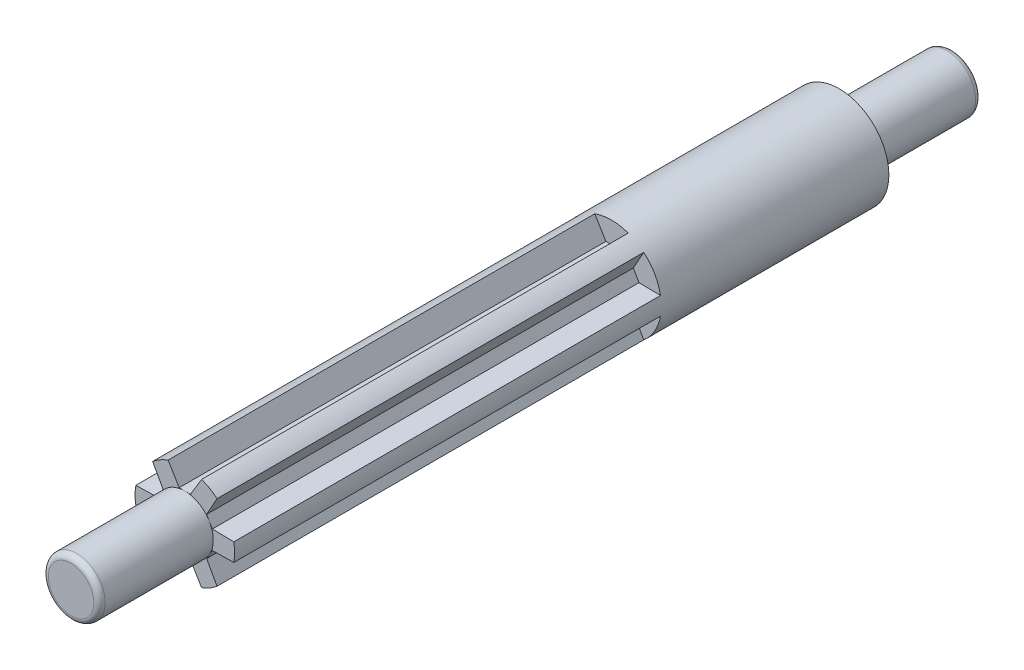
ISO-10303-21;
HEADER;
FILE_DESCRIPTION(('STEP AP214'),'2;1');
FILE_NAME('part.step','',(''),(''),'','','');
FILE_SCHEMA(('AUTOMOTIVE_DESIGN { 1 0 10303 214 1 1 1 1 }'));
ENDSEC;
DATA;
#1=APPLICATION_CONTEXT('core data for automotive mechanical design processes');
#2=APPLICATION_PROTOCOL_DEFINITION('international standard','automotive_design',2000,#1);
#3=PRODUCT_CONTEXT('',#1,'mechanical');
#4=PRODUCT('Part','Part','',(#3));
#5=PRODUCT_RELATED_PRODUCT_CATEGORY('part','',(#4));
#6=PRODUCT_DEFINITION_FORMATION('','',#4);
#7=PRODUCT_DEFINITION_CONTEXT('part definition',#1,'design');
#8=PRODUCT_DEFINITION('design','',#6,#7);
#9=PRODUCT_DEFINITION_SHAPE('','',#8);
#10=(LENGTH_UNIT() NAMED_UNIT(*) SI_UNIT(.MILLI.,.METRE.));
#11=(NAMED_UNIT(*) PLANE_ANGLE_UNIT() SI_UNIT($,.RADIAN.));
#12=(NAMED_UNIT(*) SI_UNIT($,.STERADIAN.) SOLID_ANGLE_UNIT());
#13=UNCERTAINTY_MEASURE_WITH_UNIT(LENGTH_MEASURE(1.E-05),#10,'distance_accuracy_value','');
#14=(GEOMETRIC_REPRESENTATION_CONTEXT(3) GLOBAL_UNCERTAINTY_ASSIGNED_CONTEXT((#13)) GLOBAL_UNIT_ASSIGNED_CONTEXT((#10,
#11,#12)) REPRESENTATION_CONTEXT('',''));
#15=CARTESIAN_POINT('',(0.,0.,0.));
#16=DIRECTION('',(0.,0.,1.));
#17=DIRECTION('',(1.,0.,0.));
#18=AXIS2_PLACEMENT_3D('',#15,#16,#17);
#19=CARTESIAN_POINT('',(0.,0.,23.));
#20=DIRECTION('',(0.,0.,1.));
#21=DIRECTION('',(1.,0.,0.));
#22=AXIS2_PLACEMENT_3D('',#19,#20,#21);
#23=PLANE('',#22);
#24=DIRECTION('',(0.999858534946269,-0.0168199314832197,0.));
#25=VECTOR('',#24,1.);
#26=CARTESIAN_POINT('',(0.966025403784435,0.326794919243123,23.));
#27=LINE('',#26,#25);
#28=CARTESIAN_POINT('',(0.966025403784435,0.326794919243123,23.));
#29=VERTEX_POINT('',#28);
#30=CARTESIAN_POINT('',(1.7215838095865,0.314084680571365,23.));
#31=VERTEX_POINT('',#30);
#32=EDGE_CURVE('E233',#29,#31,#27,.T.);
#33=ORIENTED_EDGE('',*,*,#32,.F.);
#34=DIRECTION('',(0.50000000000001,-0.866025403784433,0.));
#35=VECTOR('',#34,1.);
#36=CARTESIAN_POINT('',(0.766025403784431,0.673205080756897,23.));
#37=LINE('',#36,#35);
#38=CARTESIAN_POINT('',(0.866025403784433,0.50000000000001,23.));
#39=VERTEX_POINT('',#38);
#40=EDGE_CURVE('E219',#39,#29,#37,.T.);
#41=ORIENTED_EDGE('',*,*,#40,.F.);
#42=CARTESIAN_POINT('',(0.,0.,23.));
#43=DIRECTION('',(0.,0.,1.));
#44=DIRECTION('',(1.,0.,0.));
#45=AXIS2_PLACEMENT_3D('',#42,#43,#44);
#46=CIRCLE('',#45,0.999999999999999);
#47=CARTESIAN_POINT('',(0.866025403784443,-0.499999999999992,23.));
#48=VERTEX_POINT('',#47);
#49=EDGE_CURVE('E758',#48,#39,#46,.T.);
#50=ORIENTED_EDGE('',*,*,#49,.F.);
#51=DIRECTION('',(-0.499999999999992,-0.866025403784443,0.));
#52=VECTOR('',#51,1.);
#53=CARTESIAN_POINT('',(0.966025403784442,-0.326794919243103,23.));
#54=LINE('',#53,#52);
#55=CARTESIAN_POINT('',(0.966025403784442,-0.326794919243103,23.));
#56=VERTEX_POINT('',#55);
#57=EDGE_CURVE('E258',#56,#48,#54,.T.);
#58=ORIENTED_EDGE('',*,*,#57,.F.);
#59=DIRECTION('',(-0.999858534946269,-0.0168199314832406,0.));
#60=VECTOR('',#59,1.);
#61=CARTESIAN_POINT('',(2.13205080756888,-0.307179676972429,23.));
#62=LINE('',#61,#60);
#63=CARTESIAN_POINT('',(1.72158380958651,-0.314084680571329,23.));
#64=VERTEX_POINT('',#63);
#65=EDGE_CURVE('E246',#64,#56,#62,.T.);
#66=ORIENTED_EDGE('',*,*,#65,.F.);
#67=CARTESIAN_POINT('',(0.,0.,23.));
#68=DIRECTION('',(0.,0.,1.));
#69=DIRECTION('',(1.,0.,0.));
#70=AXIS2_PLACEMENT_3D('',#67,#68,#69);
#71=CIRCLE('',#70,1.75);
#72=EDGE_CURVE('E734',#64,#31,#71,.T.);
#73=ORIENTED_EDGE('',*,*,#72,.T.);
#74=EDGE_LOOP('',(#33,#41,#50,#58,#66,#73));
#75=FACE_BOUND('',#74,.T.);
#76=ADVANCED_FACE('F27',(#75),#23,.T.);
#77=DIRECTION('',(0.485362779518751,-0.874312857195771,0.));
#78=VECTOR('',#77,1.);
#79=CARTESIAN_POINT('',(0.766025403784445,-0.673205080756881,23.));
#80=LINE('',#79,#78);
#81=CARTESIAN_POINT('',(0.766025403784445,-0.673205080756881,23.));
#82=VERTEX_POINT('',#81);
#83=CARTESIAN_POINT('',(1.13279721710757,-1.33389297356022,23.));
#84=VERTEX_POINT('',#83);
#85=EDGE_CURVE('E255',#82,#84,#80,.T.);
#86=ORIENTED_EDGE('',*,*,#85,.F.);
#87=EDGE_CURVE('E260',#48,#82,#54,.T.);
#88=ORIENTED_EDGE('',*,*,#87,.F.);
#89=CARTESIAN_POINT('',(0.,-1.,23.));
#90=VERTEX_POINT('',#89);
#91=EDGE_CURVE('E757',#90,#48,#46,.T.);
#92=ORIENTED_EDGE('',*,*,#91,.F.);
#93=DIRECTION('',(-1.,0.,0.));
#94=VECTOR('',#93,1.);
#95=CARTESIAN_POINT('',(0.200000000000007,-0.999999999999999,23.));
#96=LINE('',#95,#94);
#97=CARTESIAN_POINT('',(0.200000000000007,-0.999999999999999,23.));
#98=VERTEX_POINT('',#97);
#99=EDGE_CURVE('E278',#98,#90,#96,.T.);
#100=ORIENTED_EDGE('',*,*,#99,.F.);
#101=DIRECTION('',(-0.514495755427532,0.857492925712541,0.));
#102=VECTOR('',#101,1.);
#103=CARTESIAN_POINT('',(0.800000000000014,-1.99999999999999,23.));
#104=LINE('',#103,#102);
#105=CARTESIAN_POINT('',(0.58878659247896,-1.64797765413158,23.));
#106=VERTEX_POINT('',#105);
#107=EDGE_CURVE('E265',#106,#98,#104,.T.);
#108=ORIENTED_EDGE('',*,*,#107,.F.);
#109=EDGE_CURVE('E737',#106,#84,#71,.T.);
#110=ORIENTED_EDGE('',*,*,#109,.T.);
#111=EDGE_LOOP('',(#86,#88,#92,#100,#108,#110));
#112=FACE_BOUND('',#111,.T.);
#113=ADVANCED_FACE('F426',(#112),#23,.T.);
#114=DIRECTION('',(-0.51449575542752,-0.857492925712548,0.));
#115=VECTOR('',#114,1.);
#116=CARTESIAN_POINT('',(-0.199999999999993,-1.,23.));
#117=LINE('',#116,#115);
#118=CARTESIAN_POINT('',(-0.199999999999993,-1.,23.));
#119=VERTEX_POINT('',#118);
#120=CARTESIAN_POINT('',(-0.588786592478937,-1.64797765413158,23.));
#121=VERTEX_POINT('',#120);
#122=EDGE_CURVE('E275',#119,#121,#117,.T.);
#123=ORIENTED_EDGE('',*,*,#122,.F.);
#124=EDGE_CURVE('E280',#90,#119,#96,.T.);
#125=ORIENTED_EDGE('',*,*,#124,.F.);
#126=CARTESIAN_POINT('',(-0.866025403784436,-0.500000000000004,23.));
#127=VERTEX_POINT('',#126);
#128=EDGE_CURVE('E484',#127,#90,#46,.T.);
#129=ORIENTED_EDGE('',*,*,#128,.F.);
#130=DIRECTION('',(-0.500000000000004,0.866025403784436,0.));
#131=VECTOR('',#130,1.);
#132=CARTESIAN_POINT('',(-0.766025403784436,-0.673205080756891,23.));
#133=LINE('',#132,#131);
#134=CARTESIAN_POINT('',(-0.766025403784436,-0.673205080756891,23.));
#135=VERTEX_POINT('',#134);
#136=EDGE_CURVE('E284',#135,#127,#133,.T.);
#137=ORIENTED_EDGE('',*,*,#136,.F.);
#138=DIRECTION('',(0.485362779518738,0.874312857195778,0.));
#139=VECTOR('',#138,1.);
#140=CARTESIAN_POINT('',(-1.33205080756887,-1.69282032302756,23.));
#141=LINE('',#140,#139);
#142=CARTESIAN_POINT('',(-1.13279721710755,-1.33389297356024,23.));
#143=VERTEX_POINT('',#142);
#144=EDGE_CURVE('E277',#143,#135,#141,.T.);
#145=ORIENTED_EDGE('',*,*,#144,.F.);
#146=EDGE_CURVE('E739',#143,#121,#71,.T.);
#147=ORIENTED_EDGE('',*,*,#146,.T.);
#148=EDGE_LOOP('',(#123,#125,#129,#137,#145,#147));
#149=FACE_BOUND('',#148,.T.);
#150=ADVANCED_FACE('F431',(#149),#23,.T.);
#151=DIRECTION('',(-0.999858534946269,0.0168199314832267,0.));
#152=VECTOR('',#151,1.);
#153=CARTESIAN_POINT('',(-0.966025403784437,-0.326794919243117,23.));
#154=LINE('',#153,#152);
#155=CARTESIAN_POINT('',(-0.966025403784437,-0.326794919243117,23.));
#156=VERTEX_POINT('',#155);
#157=CARTESIAN_POINT('',(-1.72158380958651,-0.314084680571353,23.));
#158=VERTEX_POINT('',#157);
#159=EDGE_CURVE('E286',#156,#158,#154,.T.);
#160=ORIENTED_EDGE('',*,*,#159,.F.);
#161=EDGE_CURVE('E283',#127,#156,#133,.T.);
#162=ORIENTED_EDGE('',*,*,#161,.F.);
#163=CARTESIAN_POINT('',(-0.86602540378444,0.499999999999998,23.));
#164=VERTEX_POINT('',#163);
#165=EDGE_CURVE('E347',#164,#127,#46,.T.);
#166=ORIENTED_EDGE('',*,*,#165,.F.);
#167=DIRECTION('',(0.499999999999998,0.86602540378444,0.));
#168=VECTOR('',#167,1.);
#169=CARTESIAN_POINT('',(-0.966025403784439,0.32679491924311,23.));
#170=LINE('',#169,#168);
#171=CARTESIAN_POINT('',(-0.966025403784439,0.32679491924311,23.));
#172=VERTEX_POINT('',#171);
#173=EDGE_CURVE('E304',#172,#164,#170,.T.);
#174=ORIENTED_EDGE('',*,*,#173,.F.);
#175=DIRECTION('',(0.999858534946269,0.0168199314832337,0.));
#176=VECTOR('',#175,1.);
#177=CARTESIAN_POINT('',(-2.13205080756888,0.307179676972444,23.));
#178=LINE('',#177,#176);
#179=CARTESIAN_POINT('',(-1.72158380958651,0.314084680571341,23.));
#180=VERTEX_POINT('',#179);
#181=EDGE_CURVE('E299',#180,#172,#178,.T.);
#182=ORIENTED_EDGE('',*,*,#181,.F.);
#183=EDGE_CURVE('E355',#180,#158,#71,.T.);
#184=ORIENTED_EDGE('',*,*,#183,.T.);
#185=EDGE_LOOP('',(#160,#162,#166,#174,#182,#184));
#186=FACE_BOUND('',#185,.T.);
#187=ADVANCED_FACE('F446',(#186),#23,.T.);
#188=DIRECTION('',(-0.485362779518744,0.874312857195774,0.));
#189=VECTOR('',#188,1.);
#190=CARTESIAN_POINT('',(-0.76602540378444,0.673205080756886,23.));
#191=LINE('',#190,#189);
#192=CARTESIAN_POINT('',(-0.76602540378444,0.673205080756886,23.));
#193=VERTEX_POINT('',#192);
#194=CARTESIAN_POINT('',(-1.13279721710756,1.33389297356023,23.));
#195=VERTEX_POINT('',#194);
#196=EDGE_CURVE('E306',#193,#195,#191,.T.);
#197=ORIENTED_EDGE('',*,*,#196,.F.);
#198=EDGE_CURVE('E303',#164,#193,#170,.T.);
#199=ORIENTED_EDGE('',*,*,#198,.F.);
#200=CARTESIAN_POINT('',(0.,1.,23.));
#201=VERTEX_POINT('',#200);
#202=EDGE_CURVE('E343',#201,#164,#46,.T.);
#203=ORIENTED_EDGE('',*,*,#202,.F.);
#204=DIRECTION('',(1.,0.,0.));
#205=VECTOR('',#204,1.);
#206=CARTESIAN_POINT('',(-0.2,1.,23.));
#207=LINE('',#206,#205);
#208=CARTESIAN_POINT('',(-0.2,1.,23.));
#209=VERTEX_POINT('',#208);
#210=EDGE_CURVE('E324',#209,#201,#207,.T.);
#211=ORIENTED_EDGE('',*,*,#210,.F.);
#212=DIRECTION('',(0.514495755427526,-0.857492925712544,0.));
#213=VECTOR('',#212,1.);
#214=CARTESIAN_POINT('',(-0.8,2.,23.));
#215=LINE('',#214,#213);
#216=CARTESIAN_POINT('',(-0.588786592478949,1.64797765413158,23.));
#217=VERTEX_POINT('',#216);
#218=EDGE_CURVE('E319',#217,#209,#215,.T.);
#219=ORIENTED_EDGE('',*,*,#218,.F.);
#220=EDGE_CURVE('E351',#217,#195,#71,.T.);
#221=ORIENTED_EDGE('',*,*,#220,.T.);
#222=EDGE_LOOP('',(#197,#199,#203,#211,#219,#221));
#223=FACE_BOUND('',#222,.T.);
#224=ADVANCED_FACE('F437',(#223),#23,.T.);
#225=CARTESIAN_POINT('',(0.,0.,0.));
#226=DIRECTION('',(0.,0.,1.));
#227=DIRECTION('',(1.,0.,0.));
#228=AXIS2_PLACEMENT_3D('',#225,#226,#227);
#229=PLANE('',#228);
#230=CARTESIAN_POINT('',(0.,0.,0.));
#231=DIRECTION('',(0.,0.,1.));
#232=DIRECTION('',(1.,0.,0.));
#233=AXIS2_PLACEMENT_3D('',#230,#231,#232);
#234=CIRCLE('',#233,1.75);
#235=CARTESIAN_POINT('',(1.75,0.,0.));
#236=VERTEX_POINT('',#235);
#237=EDGE_CURVE('E346',#236,#236,#234,.T.);
#238=ORIENTED_EDGE('',*,*,#237,.F.);
#239=EDGE_LOOP('',(#238));
#240=FACE_BOUND('',#239,.T.);
#241=CARTESIAN_POINT('',(0.,0.,0.));
#242=DIRECTION('',(0.,0.,1.));
#243=DIRECTION('',(1.,0.,0.));
#244=AXIS2_PLACEMENT_3D('',#241,#242,#243);
#245=CIRCLE('',#244,0.999999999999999);
#246=CARTESIAN_POINT('',(0.999999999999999,0.,0.));
#247=VERTEX_POINT('',#246);
#248=EDGE_CURVE('E354',#247,#247,#245,.F.);
#249=ORIENTED_EDGE('',*,*,#248,.F.);
#250=EDGE_LOOP('',(#249));
#251=FACE_BOUND('',#250,.T.);
#252=ADVANCED_FACE('F436',(#240,#251),#229,.F.);
#253=CARTESIAN_POINT('',(0.766025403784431,0.673205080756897,23.));
#254=VERTEX_POINT('',#253);
#255=EDGE_CURVE('E223',#254,#39,#37,.T.);
#256=ORIENTED_EDGE('',*,*,#255,.F.);
#257=DIRECTION('',(-0.485362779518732,-0.874312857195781,0.));
#258=VECTOR('',#257,1.);
#259=CARTESIAN_POINT('',(1.33205080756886,1.69282032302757,23.));
#260=LINE('',#259,#258);
#261=CARTESIAN_POINT('',(1.13279721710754,1.33389297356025,23.));
#262=VERTEX_POINT('',#261);
#263=EDGE_CURVE('E208',#262,#254,#260,.T.);
#264=ORIENTED_EDGE('',*,*,#263,.F.);
#265=CARTESIAN_POINT('',(0.588786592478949,1.64797765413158,23.));
#266=VERTEX_POINT('',#265);
#267=EDGE_CURVE('E350',#262,#266,#71,.T.);
#268=ORIENTED_EDGE('',*,*,#267,.T.);
#269=DIRECTION('',(0.514495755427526,0.857492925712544,0.));
#270=VECTOR('',#269,1.);
#271=CARTESIAN_POINT('',(0.2,1.,23.));
#272=LINE('',#271,#270);
#273=CARTESIAN_POINT('',(0.2,1.,23.));
#274=VERTEX_POINT('',#273);
#275=EDGE_CURVE('E327',#274,#266,#272,.T.);
#276=ORIENTED_EDGE('',*,*,#275,.F.);
#277=EDGE_CURVE('E323',#201,#274,#207,.T.);
#278=ORIENTED_EDGE('',*,*,#277,.F.);
#279=EDGE_CURVE('E231',#39,#201,#46,.T.);
#280=ORIENTED_EDGE('',*,*,#279,.F.);
#281=EDGE_LOOP('',(#256,#264,#268,#276,#278,#280));
#282=FACE_BOUND('',#281,.T.);
#283=ADVANCED_FACE('F229',(#282),#23,.T.);
#284=CARTESIAN_POINT('',(0.,0.,23.));
#285=DIRECTION('',(0.,0.,-1.));
#286=DIRECTION('',(-1.,0.,0.));
#287=AXIS2_PLACEMENT_3D('',#284,#285,#286);
#288=CYLINDRICAL_SURFACE('',#287,1.75);
#289=CARTESIAN_POINT('',(0.,0.,8.));
#290=DIRECTION('',(0.,0.,1.));
#291=DIRECTION('',(1.,0.,0.));
#292=AXIS2_PLACEMENT_3D('',#289,#290,#291);
#293=CIRCLE('',#292,1.75);
#294=CARTESIAN_POINT('',(1.7215838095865,0.314084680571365,8.));
#295=VERTEX_POINT('',#294);
#296=CARTESIAN_POINT('',(1.13279721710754,1.33389297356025,8.));
#297=VERTEX_POINT('',#296);
#298=EDGE_CURVE('E398',#295,#297,#293,.T.);
#299=ORIENTED_EDGE('',*,*,#298,.F.);
#300=DIRECTION('',(0.,0.,-1.));
#301=VECTOR('',#300,1.);
#302=CARTESIAN_POINT('',(1.7215838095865,0.314084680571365,23.));
#303=LINE('',#302,#301);
#304=EDGE_CURVE('E401',#295,#31,#303,.F.);
#305=ORIENTED_EDGE('',*,*,#304,.T.);
#306=ORIENTED_EDGE('',*,*,#72,.F.);
#307=DIRECTION('',(0.,0.,-1.));
#308=VECTOR('',#307,1.);
#309=CARTESIAN_POINT('',(1.72158380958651,-0.314084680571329,23.));
#310=LINE('',#309,#308);
#311=CARTESIAN_POINT('',(1.72158380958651,-0.314084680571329,8.));
#312=VERTEX_POINT('',#311);
#313=EDGE_CURVE('E392',#64,#312,#310,.T.);
#314=ORIENTED_EDGE('',*,*,#313,.T.);
#315=CARTESIAN_POINT('',(0.,0.,8.));
#316=DIRECTION('',(0.,0.,1.));
#317=DIRECTION('',(1.,0.,0.));
#318=AXIS2_PLACEMENT_3D('',#315,#316,#317);
#319=CIRCLE('',#318,1.75);
#320=CARTESIAN_POINT('',(1.13279721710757,-1.33389297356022,8.));
#321=VERTEX_POINT('',#320);
#322=EDGE_CURVE('E390',#321,#312,#319,.T.);
#323=ORIENTED_EDGE('',*,*,#322,.F.);
#324=DIRECTION('',(0.,0.,-1.));
#325=VECTOR('',#324,1.);
#326=CARTESIAN_POINT('',(1.13279721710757,-1.33389297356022,23.));
#327=LINE('',#326,#325);
#328=EDGE_CURVE('E395',#321,#84,#327,.F.);
#329=ORIENTED_EDGE('',*,*,#328,.T.);
#330=ORIENTED_EDGE('',*,*,#109,.F.);
#331=DIRECTION('',(0.,0.,-1.));
#332=VECTOR('',#331,1.);
#333=CARTESIAN_POINT('',(0.58878659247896,-1.64797765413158,23.));
#334=LINE('',#333,#332);
#335=CARTESIAN_POINT('',(0.58878659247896,-1.64797765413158,8.));
#336=VERTEX_POINT('',#335);
#337=EDGE_CURVE('E384',#106,#336,#334,.T.);
#338=ORIENTED_EDGE('',*,*,#337,.T.);
#339=CARTESIAN_POINT('',(0.,0.,8.));
#340=DIRECTION('',(0.,0.,1.));
#341=DIRECTION('',(1.,0.,0.));
#342=AXIS2_PLACEMENT_3D('',#339,#340,#341);
#343=CIRCLE('',#342,1.75);
#344=CARTESIAN_POINT('',(-0.588786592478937,-1.64797765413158,8.));
#345=VERTEX_POINT('',#344);
#346=EDGE_CURVE('E382',#345,#336,#343,.T.);
#347=ORIENTED_EDGE('',*,*,#346,.F.);
#348=DIRECTION('',(0.,0.,-1.));
#349=VECTOR('',#348,1.);
#350=CARTESIAN_POINT('',(-0.588786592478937,-1.64797765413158,23.));
#351=LINE('',#350,#349);
#352=EDGE_CURVE('E387',#345,#121,#351,.F.);
#353=ORIENTED_EDGE('',*,*,#352,.T.);
#354=ORIENTED_EDGE('',*,*,#146,.F.);
#355=DIRECTION('',(0.,0.,-1.));
#356=VECTOR('',#355,1.);
#357=CARTESIAN_POINT('',(-1.13279721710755,-1.33389297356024,23.));
#358=LINE('',#357,#356);
#359=CARTESIAN_POINT('',(-1.13279721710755,-1.33389297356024,8.));
#360=VERTEX_POINT('',#359);
#361=EDGE_CURVE('E376',#143,#360,#358,.T.);
#362=ORIENTED_EDGE('',*,*,#361,.T.);
#363=CARTESIAN_POINT('',(0.,0.,8.));
#364=DIRECTION('',(0.,0.,1.));
#365=DIRECTION('',(1.,0.,0.));
#366=AXIS2_PLACEMENT_3D('',#363,#364,#365);
#367=CIRCLE('',#366,1.75);
#368=CARTESIAN_POINT('',(-1.72158380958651,-0.314084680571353,8.));
#369=VERTEX_POINT('',#368);
#370=EDGE_CURVE('E374',#369,#360,#367,.T.);
#371=ORIENTED_EDGE('',*,*,#370,.F.);
#372=DIRECTION('',(0.,0.,-1.));
#373=VECTOR('',#372,1.);
#374=CARTESIAN_POINT('',(-1.72158380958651,-0.314084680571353,23.));
#375=LINE('',#374,#373);
#376=EDGE_CURVE('E379',#369,#158,#375,.F.);
#377=ORIENTED_EDGE('',*,*,#376,.T.);
#378=ORIENTED_EDGE('',*,*,#183,.F.);
#379=DIRECTION('',(0.,0.,-1.));
#380=VECTOR('',#379,1.);
#381=CARTESIAN_POINT('',(-1.72158380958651,0.314084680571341,23.));
#382=LINE('',#381,#380);
#383=CARTESIAN_POINT('',(-1.72158380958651,0.314084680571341,8.));
#384=VERTEX_POINT('',#383);
#385=EDGE_CURVE('E368',#180,#384,#382,.T.);
#386=ORIENTED_EDGE('',*,*,#385,.T.);
#387=CARTESIAN_POINT('',(0.,0.,8.));
#388=DIRECTION('',(0.,0.,1.));
#389=DIRECTION('',(1.,0.,0.));
#390=AXIS2_PLACEMENT_3D('',#387,#388,#389);
#391=CIRCLE('',#390,1.75);
#392=CARTESIAN_POINT('',(-1.13279721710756,1.33389297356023,8.));
#393=VERTEX_POINT('',#392);
#394=EDGE_CURVE('E366',#393,#384,#391,.T.);
#395=ORIENTED_EDGE('',*,*,#394,.F.);
#396=DIRECTION('',(0.,0.,-1.));
#397=VECTOR('',#396,1.);
#398=CARTESIAN_POINT('',(-1.13279721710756,1.33389297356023,23.));
#399=LINE('',#398,#397);
#400=EDGE_CURVE('E371',#393,#195,#399,.F.);
#401=ORIENTED_EDGE('',*,*,#400,.T.);
#402=ORIENTED_EDGE('',*,*,#220,.F.);
#403=DIRECTION('',(0.,0.,-1.));
#404=VECTOR('',#403,1.);
#405=CARTESIAN_POINT('',(-0.588786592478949,1.64797765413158,23.));
#406=LINE('',#405,#404);
#407=CARTESIAN_POINT('',(-0.588786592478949,1.64797765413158,8.));
#408=VERTEX_POINT('',#407);
#409=EDGE_CURVE('E360',#217,#408,#406,.T.);
#410=ORIENTED_EDGE('',*,*,#409,.T.);
#411=CARTESIAN_POINT('',(0.,0.,8.));
#412=DIRECTION('',(0.,0.,1.));
#413=DIRECTION('',(1.,0.,0.));
#414=AXIS2_PLACEMENT_3D('',#411,#412,#413);
#415=CIRCLE('',#414,1.75);
#416=CARTESIAN_POINT('',(0.588786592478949,1.64797765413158,8.));
#417=VERTEX_POINT('',#416);
#418=EDGE_CURVE('E358',#417,#408,#415,.T.);
#419=ORIENTED_EDGE('',*,*,#418,.F.);
#420=DIRECTION('',(0.,0.,-1.));
#421=VECTOR('',#420,1.);
#422=CARTESIAN_POINT('',(0.588786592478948,1.64797765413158,23.));
#423=LINE('',#422,#421);
#424=EDGE_CURVE('E363',#417,#266,#423,.F.);
#425=ORIENTED_EDGE('',*,*,#424,.T.);
#426=ORIENTED_EDGE('',*,*,#267,.F.);
#427=DIRECTION('',(0.,0.,-1.));
#428=VECTOR('',#427,1.);
#429=CARTESIAN_POINT('',(1.13279721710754,1.33389297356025,23.));
#430=LINE('',#429,#428);
#431=EDGE_CURVE('E215',#262,#297,#430,.T.);
#432=ORIENTED_EDGE('',*,*,#431,.T.);
#433=EDGE_LOOP('',(#299,#305,#306,#314,#323,#329,#330,#338,#347,#353,#354,#362,#371,#377,#378,
#386,#395,#401,#402,#410,#419,#425,#426,#432));
#434=FACE_BOUND('',#433,.T.);
#435=ORIENTED_EDGE('',*,*,#237,.T.);
#436=EDGE_LOOP('',(#435));
#437=FACE_BOUND('',#436,.T.);
#438=ADVANCED_FACE('F29',(#434,#437),#288,.T.);
#439=CARTESIAN_POINT('',(0.,0.,27.));
#440=DIRECTION('',(0.,0.,-1.));
#441=DIRECTION('',(-1.,0.,0.));
#442=AXIS2_PLACEMENT_3D('',#439,#440,#441);
#443=CYLINDRICAL_SURFACE('',#442,0.999999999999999);
#444=CARTESIAN_POINT('',(0.,0.,26.8));
#445=DIRECTION('',(0.,0.,1.));
#446=DIRECTION('',(1.,0.,0.));
#447=AXIS2_PLACEMENT_3D('',#444,#445,#446);
#448=CIRCLE('',#447,0.999999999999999);
#449=CARTESIAN_POINT('',(0.999999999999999,0.,26.8));
#450=VERTEX_POINT('',#449);
#451=EDGE_CURVE('E407',#450,#450,#448,.F.);
#452=ORIENTED_EDGE('',*,*,#451,.T.);
#453=EDGE_LOOP('',(#452));
#454=FACE_BOUND('',#453,.T.);
#455=ORIENTED_EDGE('',*,*,#202,.T.);
#456=ORIENTED_EDGE('',*,*,#165,.T.);
#457=ORIENTED_EDGE('',*,*,#128,.T.);
#458=ORIENTED_EDGE('',*,*,#91,.T.);
#459=ORIENTED_EDGE('',*,*,#49,.T.);
#460=ORIENTED_EDGE('',*,*,#279,.T.);
#461=EDGE_LOOP('',(#455,#456,#457,#458,#459,#460));
#462=FACE_BOUND('',#461,.T.);
#463=ADVANCED_FACE('F442',(#454,#462),#443,.T.);
#464=CARTESIAN_POINT('',(0.,0.,27.));
#465=DIRECTION('',(0.,0.,1.));
#466=DIRECTION('',(1.,0.,0.));
#467=AXIS2_PLACEMENT_3D('',#464,#465,#466);
#468=PLANE('',#467);
#469=CARTESIAN_POINT('',(0.,0.,27.));
#470=DIRECTION('',(0.,0.,1.));
#471=DIRECTION('',(1.,0.,0.));
#472=AXIS2_PLACEMENT_3D('',#469,#470,#471);
#473=CIRCLE('',#472,0.799999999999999);
#474=CARTESIAN_POINT('',(0.799999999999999,0.,27.));
#475=VERTEX_POINT('',#474);
#476=EDGE_CURVE('E404',#475,#475,#473,.T.);
#477=ORIENTED_EDGE('',*,*,#476,.T.);
#478=EDGE_LOOP('',(#477));
#479=FACE_BOUND('',#478,.T.);
#480=ADVANCED_FACE('F516',(#479),#468,.T.);
#481=CARTESIAN_POINT('',(0.,0.,-4.));
#482=DIRECTION('',(0.,0.,1.));
#483=DIRECTION('',(1.,0.,0.));
#484=AXIS2_PLACEMENT_3D('',#481,#482,#483);
#485=CYLINDRICAL_SURFACE('',#484,0.999999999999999);
#486=CARTESIAN_POINT('',(0.,0.,-3.8));
#487=DIRECTION('',(0.,0.,-1.));
#488=DIRECTION('',(-1.,0.,0.));
#489=AXIS2_PLACEMENT_3D('',#486,#487,#488);
#490=CIRCLE('',#489,0.999999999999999);
#491=CARTESIAN_POINT('',(-0.999999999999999,0.,-3.8));
#492=VERTEX_POINT('',#491);
#493=EDGE_CURVE('E11',#492,#492,#490,.F.);
#494=ORIENTED_EDGE('',*,*,#493,.T.);
#495=EDGE_LOOP('',(#494));
#496=FACE_BOUND('',#495,.T.);
#497=ORIENTED_EDGE('',*,*,#248,.T.);
#498=EDGE_LOOP('',(#497));
#499=FACE_BOUND('',#498,.T.);
#500=ADVANCED_FACE('F513',(#496,#499),#485,.T.);
#501=CARTESIAN_POINT('',(0.,0.,-4.));
#502=DIRECTION('',(0.,0.,-1.));
#503=DIRECTION('',(-1.,0.,0.));
#504=AXIS2_PLACEMENT_3D('',#501,#502,#503);
#505=PLANE('',#504);
#506=CARTESIAN_POINT('',(0.,0.,-4.));
#507=DIRECTION('',(0.,0.,-1.));
#508=DIRECTION('',(-1.,0.,0.));
#509=AXIS2_PLACEMENT_3D('',#506,#507,#508);
#510=CIRCLE('',#509,0.799999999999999);
#511=CARTESIAN_POINT('',(-0.799999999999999,0.,-4.));
#512=VERTEX_POINT('',#511);
#513=EDGE_CURVE('E35',#512,#512,#510,.T.);
#514=ORIENTED_EDGE('',*,*,#513,.T.);
#515=EDGE_LOOP('',(#514));
#516=FACE_BOUND('',#515,.T.);
#517=ADVANCED_FACE('F412',(#516),#505,.T.);
#518=CARTESIAN_POINT('',(0.2,1.,8.));
#519=DIRECTION('',(0.857492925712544,-0.514495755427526,0.));
#520=DIRECTION('',(0.514495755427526,0.857492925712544,0.));
#521=AXIS2_PLACEMENT_3D('',#518,#519,#520);
#522=PLANE('',#521);
#523=DIRECTION('',(0.514495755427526,0.857492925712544,0.));
#524=VECTOR('',#523,1.);
#525=CARTESIAN_POINT('',(0.2,1.,8.));
#526=LINE('',#525,#524);
#527=CARTESIAN_POINT('',(0.2,1.,8.));
#528=VERTEX_POINT('',#527);
#529=EDGE_CURVE('E335',#528,#417,#526,.T.);
#530=ORIENTED_EDGE('',*,*,#529,.F.);
#531=DIRECTION('',(0.,0.,1.));
#532=VECTOR('',#531,1.);
#533=CARTESIAN_POINT('',(0.2,1.,8.));
#534=LINE('',#533,#532);
#535=EDGE_CURVE('E338',#528,#274,#534,.T.);
#536=ORIENTED_EDGE('',*,*,#535,.T.);
#537=ORIENTED_EDGE('',*,*,#275,.T.);
#538=ORIENTED_EDGE('',*,*,#424,.F.);
#539=EDGE_LOOP('',(#530,#536,#537,#538));
#540=FACE_BOUND('',#539,.T.);
#541=ADVANCED_FACE('F494',(#540),#522,.F.);
#542=CARTESIAN_POINT('',(-0.8,2.,8.));
#543=DIRECTION('',(-0.857492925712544,-0.514495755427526,0.));
#544=DIRECTION('',(0.514495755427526,-0.857492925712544,0.));
#545=AXIS2_PLACEMENT_3D('',#542,#543,#544);
#546=PLANE('',#545);
#547=ORIENTED_EDGE('',*,*,#218,.T.);
#548=DIRECTION('',(0.,0.,1.));
#549=VECTOR('',#548,1.);
#550=CARTESIAN_POINT('',(-0.2,1.,8.));
#551=LINE('',#550,#549);
#552=CARTESIAN_POINT('',(-0.2,1.,8.));
#553=VERTEX_POINT('',#552);
#554=EDGE_CURVE('E337',#553,#209,#551,.T.);
#555=ORIENTED_EDGE('',*,*,#554,.F.);
#556=DIRECTION('',(0.514495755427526,-0.857492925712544,0.));
#557=VECTOR('',#556,1.);
#558=CARTESIAN_POINT('',(-0.8,2.,8.));
#559=LINE('',#558,#557);
#560=EDGE_CURVE('E330',#408,#553,#559,.T.);
#561=ORIENTED_EDGE('',*,*,#560,.F.);
#562=ORIENTED_EDGE('',*,*,#409,.F.);
#563=EDGE_LOOP('',(#547,#555,#561,#562));
#564=FACE_BOUND('',#563,.T.);
#565=ADVANCED_FACE('F500',(#564),#546,.F.);
#566=CARTESIAN_POINT('',(-0.8,2.,8.));
#567=DIRECTION('',(0.,0.,1.));
#568=DIRECTION('',(1.,0.,0.));
#569=AXIS2_PLACEMENT_3D('',#566,#567,#568);
#570=PLANE('',#569);
#571=ORIENTED_EDGE('',*,*,#418,.T.);
#572=ORIENTED_EDGE('',*,*,#560,.T.);
#573=DIRECTION('',(1.,0.,0.));
#574=VECTOR('',#573,1.);
#575=CARTESIAN_POINT('',(-0.2,1.,8.));
#576=LINE('',#575,#574);
#577=EDGE_CURVE('E332',#553,#528,#576,.T.);
#578=ORIENTED_EDGE('',*,*,#577,.T.);
#579=ORIENTED_EDGE('',*,*,#529,.T.);
#580=EDGE_LOOP('',(#571,#572,#578,#579));
#581=FACE_BOUND('',#580,.T.);
#582=ADVANCED_FACE('F498',(#581),#570,.T.);
#583=CARTESIAN_POINT('',(-0.2,1.,8.));
#584=DIRECTION('',(0.,-1.,0.));
#585=DIRECTION('',(0.,0.,-1.));
#586=AXIS2_PLACEMENT_3D('',#583,#584,#585);
#587=PLANE('',#586);
#588=ORIENTED_EDGE('',*,*,#210,.T.);
#589=ORIENTED_EDGE('',*,*,#277,.T.);
#590=ORIENTED_EDGE('',*,*,#535,.F.);
#591=ORIENTED_EDGE('',*,*,#577,.F.);
#592=ORIENTED_EDGE('',*,*,#554,.T.);
#593=EDGE_LOOP('',(#588,#589,#590,#591,#592));
#594=FACE_BOUND('',#593,.T.);
#595=ADVANCED_FACE('F487',(#594),#587,.F.);
#596=CARTESIAN_POINT('',(-0.76602540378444,0.673205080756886,8.));
#597=DIRECTION('',(0.874312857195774,0.485362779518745,0.));
#598=DIRECTION('',(-0.485362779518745,0.874312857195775,0.));
#599=AXIS2_PLACEMENT_3D('',#596,#597,#598);
#600=PLANE('',#599);
#601=DIRECTION('',(-0.485362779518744,0.874312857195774,0.));
#602=VECTOR('',#601,1.);
#603=CARTESIAN_POINT('',(-0.76602540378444,0.673205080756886,8.));
#604=LINE('',#603,#602);
#605=CARTESIAN_POINT('',(-0.76602540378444,0.673205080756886,8.));
#606=VERTEX_POINT('',#605);
#607=EDGE_CURVE('E313',#606,#393,#604,.T.);
#608=ORIENTED_EDGE('',*,*,#607,.F.);
#609=DIRECTION('',(0.,0.,1.));
#610=VECTOR('',#609,1.);
#611=CARTESIAN_POINT('',(-0.76602540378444,0.673205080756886,8.));
#612=LINE('',#611,#610);
#613=EDGE_CURVE('E316',#606,#193,#612,.T.);
#614=ORIENTED_EDGE('',*,*,#613,.T.);
#615=ORIENTED_EDGE('',*,*,#196,.T.);
#616=ORIENTED_EDGE('',*,*,#400,.F.);
#617=EDGE_LOOP('',(#608,#614,#615,#616));
#618=FACE_BOUND('',#617,.T.);
#619=ADVANCED_FACE('F461',(#618),#600,.F.);
#620=CARTESIAN_POINT('',(-2.13205080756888,0.307179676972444,8.));
#621=DIRECTION('',(0.0168199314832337,-0.999858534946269,0.));
#622=DIRECTION('',(0.999858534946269,0.0168199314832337,0.));
#623=AXIS2_PLACEMENT_3D('',#620,#621,#622);
#624=PLANE('',#623);
#625=ORIENTED_EDGE('',*,*,#181,.T.);
#626=DIRECTION('',(0.,0.,1.));
#627=VECTOR('',#626,1.);
#628=CARTESIAN_POINT('',(-0.966025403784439,0.32679491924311,8.));
#629=LINE('',#628,#627);
#630=CARTESIAN_POINT('',(-0.966025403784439,0.32679491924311,8.));
#631=VERTEX_POINT('',#630);
#632=EDGE_CURVE('E315',#631,#172,#629,.T.);
#633=ORIENTED_EDGE('',*,*,#632,.F.);
#634=DIRECTION('',(0.999858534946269,0.0168199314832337,0.));
#635=VECTOR('',#634,1.);
#636=CARTESIAN_POINT('',(-2.13205080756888,0.307179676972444,8.));
#637=LINE('',#636,#635);
#638=EDGE_CURVE('E308',#384,#631,#637,.T.);
#639=ORIENTED_EDGE('',*,*,#638,.F.);
#640=ORIENTED_EDGE('',*,*,#385,.F.);
#641=EDGE_LOOP('',(#625,#633,#639,#640));
#642=FACE_BOUND('',#641,.T.);
#643=ADVANCED_FACE('F471',(#642),#624,.F.);
#644=CARTESIAN_POINT('',(-2.13205080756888,0.307179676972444,8.));
#645=DIRECTION('',(0.,0.,1.));
#646=DIRECTION('',(0.499999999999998,0.86602540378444,0.));
#647=AXIS2_PLACEMENT_3D('',#644,#645,#646);
#648=PLANE('',#647);
#649=ORIENTED_EDGE('',*,*,#394,.T.);
#650=ORIENTED_EDGE('',*,*,#638,.T.);
#651=DIRECTION('',(0.499999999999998,0.86602540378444,0.));
#652=VECTOR('',#651,1.);
#653=CARTESIAN_POINT('',(-0.966025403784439,0.32679491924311,8.));
#654=LINE('',#653,#652);
#655=EDGE_CURVE('E310',#631,#606,#654,.T.);
#656=ORIENTED_EDGE('',*,*,#655,.T.);
#657=ORIENTED_EDGE('',*,*,#607,.T.);
#658=EDGE_LOOP('',(#649,#650,#656,#657));
#659=FACE_BOUND('',#658,.T.);
#660=ADVANCED_FACE('F468',(#659),#648,.T.);
#661=CARTESIAN_POINT('',(-0.966025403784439,0.32679491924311,8.));
#662=DIRECTION('',(0.86602540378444,-0.499999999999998,0.));
#663=DIRECTION('',(0.499999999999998,0.86602540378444,0.));
#664=AXIS2_PLACEMENT_3D('',#661,#662,#663);
#665=PLANE('',#664);
#666=ORIENTED_EDGE('',*,*,#173,.T.);
#667=ORIENTED_EDGE('',*,*,#198,.T.);
#668=ORIENTED_EDGE('',*,*,#613,.F.);
#669=ORIENTED_EDGE('',*,*,#655,.F.);
#670=ORIENTED_EDGE('',*,*,#632,.T.);
#671=EDGE_LOOP('',(#666,#667,#668,#669,#670));
#672=FACE_BOUND('',#671,.T.);
#673=ADVANCED_FACE('F476',(#672),#665,.F.);
#674=CARTESIAN_POINT('',(-0.966025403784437,-0.326794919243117,8.));
#675=DIRECTION('',(0.0168199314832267,0.999858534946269,0.));
#676=DIRECTION('',(-0.999858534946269,0.0168199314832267,0.));
#677=AXIS2_PLACEMENT_3D('',#674,#675,#676);
#678=PLANE('',#677);
#679=DIRECTION('',(-0.999858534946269,0.0168199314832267,0.));
#680=VECTOR('',#679,1.);
#681=CARTESIAN_POINT('',(-0.966025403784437,-0.326794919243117,8.));
#682=LINE('',#681,#680);
#683=CARTESIAN_POINT('',(-0.966025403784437,-0.326794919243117,8.));
#684=VERTEX_POINT('',#683);
#685=EDGE_CURVE('E293',#684,#369,#682,.T.);
#686=ORIENTED_EDGE('',*,*,#685,.F.);
#687=DIRECTION('',(0.,0.,1.));
#688=VECTOR('',#687,1.);
#689=CARTESIAN_POINT('',(-0.966025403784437,-0.326794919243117,8.));
#690=LINE('',#689,#688);
#691=EDGE_CURVE('E296',#684,#156,#690,.T.);
#692=ORIENTED_EDGE('',*,*,#691,.T.);
#693=ORIENTED_EDGE('',*,*,#159,.T.);
#694=ORIENTED_EDGE('',*,*,#376,.F.);
#695=EDGE_LOOP('',(#686,#692,#693,#694));
#696=FACE_BOUND('',#695,.T.);
#697=ADVANCED_FACE('F603',(#696),#678,.F.);
#698=CARTESIAN_POINT('',(-1.33205080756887,-1.69282032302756,8.));
#699=DIRECTION('',(0.874312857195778,-0.485362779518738,0.));
#700=DIRECTION('',(0.485362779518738,0.874312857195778,0.));
#701=AXIS2_PLACEMENT_3D('',#698,#699,#700);
#702=PLANE('',#701);
#703=ORIENTED_EDGE('',*,*,#144,.T.);
#704=DIRECTION('',(0.,0.,1.));
#705=VECTOR('',#704,1.);
#706=CARTESIAN_POINT('',(-0.766025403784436,-0.673205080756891,8.));
#707=LINE('',#706,#705);
#708=CARTESIAN_POINT('',(-0.766025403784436,-0.673205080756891,8.));
#709=VERTEX_POINT('',#708);
#710=EDGE_CURVE('E295',#709,#135,#707,.T.);
#711=ORIENTED_EDGE('',*,*,#710,.F.);
#712=DIRECTION('',(0.485362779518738,0.874312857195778,0.));
#713=VECTOR('',#712,1.);
#714=CARTESIAN_POINT('',(-1.33205080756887,-1.69282032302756,8.));
#715=LINE('',#714,#713);
#716=EDGE_CURVE('E288',#360,#709,#715,.T.);
#717=ORIENTED_EDGE('',*,*,#716,.F.);
#718=ORIENTED_EDGE('',*,*,#361,.F.);
#719=EDGE_LOOP('',(#703,#711,#717,#718));
#720=FACE_BOUND('',#719,.T.);
#721=ADVANCED_FACE('F610',(#720),#702,.F.);
#722=CARTESIAN_POINT('',(-1.33205080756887,-1.69282032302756,8.));
#723=DIRECTION('',(0.,0.,1.));
#724=DIRECTION('',(-0.500000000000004,0.866025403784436,0.));
#725=AXIS2_PLACEMENT_3D('',#722,#723,#724);
#726=PLANE('',#725);
#727=ORIENTED_EDGE('',*,*,#370,.T.);
#728=ORIENTED_EDGE('',*,*,#716,.T.);
#729=DIRECTION('',(-0.500000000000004,0.866025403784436,0.));
#730=VECTOR('',#729,1.);
#731=CARTESIAN_POINT('',(-0.766025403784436,-0.673205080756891,8.));
#732=LINE('',#731,#730);
#733=EDGE_CURVE('E290',#709,#684,#732,.T.);
#734=ORIENTED_EDGE('',*,*,#733,.T.);
#735=ORIENTED_EDGE('',*,*,#685,.T.);
#736=EDGE_LOOP('',(#727,#728,#734,#735));
#737=FACE_BOUND('',#736,.T.);
#738=ADVANCED_FACE('F618',(#737),#726,.T.);
#739=CARTESIAN_POINT('',(-0.766025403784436,-0.673205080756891,8.));
#740=DIRECTION('',(0.866025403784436,0.500000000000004,0.));
#741=DIRECTION('',(-0.500000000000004,0.866025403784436,0.));
#742=AXIS2_PLACEMENT_3D('',#739,#740,#741);
#743=PLANE('',#742);
#744=ORIENTED_EDGE('',*,*,#136,.T.);
#745=ORIENTED_EDGE('',*,*,#161,.T.);
#746=ORIENTED_EDGE('',*,*,#691,.F.);
#747=ORIENTED_EDGE('',*,*,#733,.F.);
#748=ORIENTED_EDGE('',*,*,#710,.T.);
#749=EDGE_LOOP('',(#744,#745,#746,#747,#748));
#750=FACE_BOUND('',#749,.T.);
#751=ADVANCED_FACE('F626',(#750),#743,.F.);
#752=CARTESIAN_POINT('',(-0.199999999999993,-1.,8.));
#753=DIRECTION('',(-0.857492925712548,0.514495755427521,0.));
#754=DIRECTION('',(-0.514495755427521,-0.857492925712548,0.));
#755=AXIS2_PLACEMENT_3D('',#752,#753,#754);
#756=PLANE('',#755);
#757=DIRECTION('',(-0.51449575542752,-0.857492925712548,0.));
#758=VECTOR('',#757,1.);
#759=CARTESIAN_POINT('',(-0.199999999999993,-1.,8.));
#760=LINE('',#759,#758);
#761=CARTESIAN_POINT('',(-0.199999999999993,-1.,8.));
#762=VERTEX_POINT('',#761);
#763=EDGE_CURVE('E257',#762,#345,#760,.T.);
#764=ORIENTED_EDGE('',*,*,#763,.F.);
#765=DIRECTION('',(0.,0.,1.));
#766=VECTOR('',#765,1.);
#767=CARTESIAN_POINT('',(-0.199999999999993,-1.,8.));
#768=LINE('',#767,#766);
#769=EDGE_CURVE('E267',#762,#119,#768,.T.);
#770=ORIENTED_EDGE('',*,*,#769,.T.);
#771=ORIENTED_EDGE('',*,*,#122,.T.);
#772=ORIENTED_EDGE('',*,*,#352,.F.);
#773=EDGE_LOOP('',(#764,#770,#771,#772));
#774=FACE_BOUND('',#773,.T.);
#775=ADVANCED_FACE('F634',(#774),#756,.F.);
#776=CARTESIAN_POINT('',(0.800000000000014,-1.99999999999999,8.));
#777=DIRECTION('',(0.857492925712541,0.514495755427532,0.));
#778=DIRECTION('',(-0.514495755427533,0.857492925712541,0.));
#779=AXIS2_PLACEMENT_3D('',#776,#777,#778);
#780=PLANE('',#779);
#781=ORIENTED_EDGE('',*,*,#107,.T.);
#782=DIRECTION('',(0.,0.,1.));
#783=VECTOR('',#782,1.);
#784=CARTESIAN_POINT('',(0.200000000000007,-0.999999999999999,8.));
#785=LINE('',#784,#783);
#786=CARTESIAN_POINT('',(0.200000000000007,-0.999999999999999,8.));
#787=VERTEX_POINT('',#786);
#788=EDGE_CURVE('E262',#787,#98,#785,.T.);
#789=ORIENTED_EDGE('',*,*,#788,.F.);
#790=DIRECTION('',(-0.514495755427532,0.857492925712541,0.));
#791=VECTOR('',#790,1.);
#792=CARTESIAN_POINT('',(0.800000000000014,-1.99999999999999,8.));
#793=LINE('',#792,#791);
#794=EDGE_CURVE('E266',#336,#787,#793,.T.);
#795=ORIENTED_EDGE('',*,*,#794,.F.);
#796=ORIENTED_EDGE('',*,*,#337,.F.);
#797=EDGE_LOOP('',(#781,#789,#795,#796));
#798=FACE_BOUND('',#797,.T.);
#799=ADVANCED_FACE('F642',(#798),#780,.F.);
#800=CARTESIAN_POINT('',(0.800000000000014,-1.99999999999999,8.));
#801=DIRECTION('',(0.,0.,1.));
#802=DIRECTION('',(-1.,0.,0.));
#803=AXIS2_PLACEMENT_3D('',#800,#801,#802);
#804=PLANE('',#803);
#805=ORIENTED_EDGE('',*,*,#346,.T.);
#806=ORIENTED_EDGE('',*,*,#794,.T.);
#807=DIRECTION('',(-1.,0.,0.));
#808=VECTOR('',#807,1.);
#809=CARTESIAN_POINT('',(0.200000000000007,-0.999999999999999,8.));
#810=LINE('',#809,#808);
#811=EDGE_CURVE('E270',#787,#762,#810,.T.);
#812=ORIENTED_EDGE('',*,*,#811,.T.);
#813=ORIENTED_EDGE('',*,*,#763,.T.);
#814=EDGE_LOOP('',(#805,#806,#812,#813));
#815=FACE_BOUND('',#814,.T.);
#816=ADVANCED_FACE('F650',(#815),#804,.T.);
#817=CARTESIAN_POINT('',(0.200000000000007,-0.999999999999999,8.));
#818=DIRECTION('',(0.,1.,0.));
#819=DIRECTION('',(-1.,0.,0.));
#820=AXIS2_PLACEMENT_3D('',#817,#818,#819);
#821=PLANE('',#820);
#822=ORIENTED_EDGE('',*,*,#99,.T.);
#823=ORIENTED_EDGE('',*,*,#124,.T.);
#824=ORIENTED_EDGE('',*,*,#769,.F.);
#825=ORIENTED_EDGE('',*,*,#811,.F.);
#826=ORIENTED_EDGE('',*,*,#788,.T.);
#827=EDGE_LOOP('',(#822,#823,#824,#825,#826));
#828=FACE_BOUND('',#827,.T.);
#829=ADVANCED_FACE('F658',(#828),#821,.F.);
#830=CARTESIAN_POINT('',(0.766025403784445,-0.673205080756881,8.));
#831=DIRECTION('',(-0.874312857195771,-0.485362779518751,0.));
#832=DIRECTION('',(0.485362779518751,-0.874312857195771,0.));
#833=AXIS2_PLACEMENT_3D('',#830,#831,#832);
#834=PLANE('',#833);
#835=DIRECTION('',(0.485362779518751,-0.874312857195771,0.));
#836=VECTOR('',#835,1.);
#837=CARTESIAN_POINT('',(0.766025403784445,-0.673205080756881,8.));
#838=LINE('',#837,#836);
#839=CARTESIAN_POINT('',(0.766025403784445,-0.673205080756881,8.));
#840=VERTEX_POINT('',#839);
#841=EDGE_CURVE('E50',#840,#321,#838,.T.);
#842=ORIENTED_EDGE('',*,*,#841,.F.);
#843=DIRECTION('',(0.,0.,1.));
#844=VECTOR('',#843,1.);
#845=CARTESIAN_POINT('',(0.766025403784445,-0.673205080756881,8.));
#846=LINE('',#845,#844);
#847=EDGE_CURVE('E248',#840,#82,#846,.T.);
#848=ORIENTED_EDGE('',*,*,#847,.T.);
#849=ORIENTED_EDGE('',*,*,#85,.T.);
#850=ORIENTED_EDGE('',*,*,#328,.F.);
#851=EDGE_LOOP('',(#842,#848,#849,#850));
#852=FACE_BOUND('',#851,.T.);
#853=ADVANCED_FACE('F666',(#852),#834,.F.);
#854=CARTESIAN_POINT('',(2.13205080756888,-0.307179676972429,8.));
#855=DIRECTION('',(-0.0168199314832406,0.999858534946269,0.));
#856=DIRECTION('',(-0.999858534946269,-0.0168199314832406,0.));
#857=AXIS2_PLACEMENT_3D('',#854,#855,#856);
#858=PLANE('',#857);
#859=ORIENTED_EDGE('',*,*,#65,.T.);
#860=DIRECTION('',(0.,0.,1.));
#861=VECTOR('',#860,1.);
#862=CARTESIAN_POINT('',(0.966025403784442,-0.326794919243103,8.));
#863=LINE('',#862,#861);
#864=CARTESIAN_POINT('',(0.966025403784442,-0.326794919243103,8.));
#865=VERTEX_POINT('',#864);
#866=EDGE_CURVE('E243',#865,#56,#863,.T.);
#867=ORIENTED_EDGE('',*,*,#866,.F.);
#868=DIRECTION('',(-0.999858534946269,-0.0168199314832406,0.));
#869=VECTOR('',#868,1.);
#870=CARTESIAN_POINT('',(2.13205080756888,-0.307179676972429,8.));
#871=LINE('',#870,#869);
#872=EDGE_CURVE('E247',#312,#865,#871,.T.);
#873=ORIENTED_EDGE('',*,*,#872,.F.);
#874=ORIENTED_EDGE('',*,*,#313,.F.);
#875=EDGE_LOOP('',(#859,#867,#873,#874));
#876=FACE_BOUND('',#875,.T.);
#877=ADVANCED_FACE('F674',(#876),#858,.F.);
#878=CARTESIAN_POINT('',(2.13205080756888,-0.307179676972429,8.));
#879=DIRECTION('',(0.,0.,1.));
#880=DIRECTION('',(-0.499999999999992,-0.866025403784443,0.));
#881=AXIS2_PLACEMENT_3D('',#878,#879,#880);
#882=PLANE('',#881);
#883=ORIENTED_EDGE('',*,*,#322,.T.);
#884=ORIENTED_EDGE('',*,*,#872,.T.);
#885=DIRECTION('',(-0.499999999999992,-0.866025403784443,0.));
#886=VECTOR('',#885,1.);
#887=CARTESIAN_POINT('',(0.966025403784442,-0.326794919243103,8.));
#888=LINE('',#887,#886);
#889=EDGE_CURVE('E251',#865,#840,#888,.T.);
#890=ORIENTED_EDGE('',*,*,#889,.T.);
#891=ORIENTED_EDGE('',*,*,#841,.T.);
#892=EDGE_LOOP('',(#883,#884,#890,#891));
#893=FACE_BOUND('',#892,.T.);
#894=ADVANCED_FACE('F682',(#893),#882,.T.);
#895=CARTESIAN_POINT('',(0.966025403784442,-0.326794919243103,8.));
#896=DIRECTION('',(-0.866025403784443,0.499999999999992,0.));
#897=DIRECTION('',(-0.499999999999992,-0.866025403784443,0.));
#898=AXIS2_PLACEMENT_3D('',#895,#896,#897);
#899=PLANE('',#898);
#900=ORIENTED_EDGE('',*,*,#57,.T.);
#901=ORIENTED_EDGE('',*,*,#87,.T.);
#902=ORIENTED_EDGE('',*,*,#847,.F.);
#903=ORIENTED_EDGE('',*,*,#889,.F.);
#904=ORIENTED_EDGE('',*,*,#866,.T.);
#905=EDGE_LOOP('',(#900,#901,#902,#903,#904));
#906=FACE_BOUND('',#905,.T.);
#907=ADVANCED_FACE('F690',(#906),#899,.F.);
#908=CARTESIAN_POINT('',(0.966025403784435,0.326794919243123,8.));
#909=DIRECTION('',(-0.0168199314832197,-0.999858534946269,0.));
#910=DIRECTION('',(0.999858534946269,-0.0168199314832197,0.));
#911=AXIS2_PLACEMENT_3D('',#908,#909,#910);
#912=PLANE('',#911);
#913=DIRECTION('',(0.999858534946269,-0.0168199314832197,0.));
#914=VECTOR('',#913,1.);
#915=CARTESIAN_POINT('',(0.966025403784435,0.326794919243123,8.));
#916=LINE('',#915,#914);
#917=CARTESIAN_POINT('',(0.966025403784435,0.326794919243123,8.));
#918=VERTEX_POINT('',#917);
#919=EDGE_CURVE('E42',#918,#295,#916,.T.);
#920=ORIENTED_EDGE('',*,*,#919,.F.);
#921=DIRECTION('',(0.,0.,1.));
#922=VECTOR('',#921,1.);
#923=CARTESIAN_POINT('',(0.966025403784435,0.326794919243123,8.));
#924=LINE('',#923,#922);
#925=EDGE_CURVE('E226',#918,#29,#924,.T.);
#926=ORIENTED_EDGE('',*,*,#925,.T.);
#927=ORIENTED_EDGE('',*,*,#32,.T.);
#928=ORIENTED_EDGE('',*,*,#304,.F.);
#929=EDGE_LOOP('',(#920,#926,#927,#928));
#930=FACE_BOUND('',#929,.T.);
#931=ADVANCED_FACE('F697',(#930),#912,.F.);
#932=CARTESIAN_POINT('',(1.33205080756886,1.69282032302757,8.));
#933=DIRECTION('',(-0.874312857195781,0.485362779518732,0.));
#934=DIRECTION('',(-0.485362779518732,-0.874312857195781,0.));
#935=AXIS2_PLACEMENT_3D('',#932,#933,#934);
#936=PLANE('',#935);
#937=ORIENTED_EDGE('',*,*,#263,.T.);
#938=DIRECTION('',(0.,0.,1.));
#939=VECTOR('',#938,1.);
#940=CARTESIAN_POINT('',(0.766025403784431,0.673205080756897,8.));
#941=LINE('',#940,#939);
#942=CARTESIAN_POINT('',(0.766025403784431,0.673205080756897,8.));
#943=VERTEX_POINT('',#942);
#944=EDGE_CURVE('E212',#943,#254,#941,.T.);
#945=ORIENTED_EDGE('',*,*,#944,.F.);
#946=DIRECTION('',(-0.485362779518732,-0.874312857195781,0.));
#947=VECTOR('',#946,1.);
#948=CARTESIAN_POINT('',(1.33205080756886,1.69282032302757,8.));
#949=LINE('',#948,#947);
#950=EDGE_CURVE('E235',#297,#943,#949,.T.);
#951=ORIENTED_EDGE('',*,*,#950,.F.);
#952=ORIENTED_EDGE('',*,*,#431,.F.);
#953=EDGE_LOOP('',(#937,#945,#951,#952));
#954=FACE_BOUND('',#953,.T.);
#955=ADVANCED_FACE('F210',(#954),#936,.F.);
#956=CARTESIAN_POINT('',(1.33205080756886,1.69282032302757,8.));
#957=DIRECTION('',(0.,0.,1.));
#958=DIRECTION('',(0.50000000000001,-0.866025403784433,0.));
#959=AXIS2_PLACEMENT_3D('',#956,#957,#958);
#960=PLANE('',#959);
#961=ORIENTED_EDGE('',*,*,#298,.T.);
#962=ORIENTED_EDGE('',*,*,#950,.T.);
#963=DIRECTION('',(0.50000000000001,-0.866025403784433,0.));
#964=VECTOR('',#963,1.);
#965=CARTESIAN_POINT('',(0.766025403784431,0.673205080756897,8.));
#966=LINE('',#965,#964);
#967=EDGE_CURVE('E225',#943,#918,#966,.T.);
#968=ORIENTED_EDGE('',*,*,#967,.T.);
#969=ORIENTED_EDGE('',*,*,#919,.T.);
#970=EDGE_LOOP('',(#961,#962,#968,#969));
#971=FACE_BOUND('',#970,.T.);
#972=ADVANCED_FACE('F712',(#971),#960,.T.);
#973=CARTESIAN_POINT('',(0.766025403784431,0.673205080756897,8.));
#974=DIRECTION('',(-0.866025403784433,-0.50000000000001,0.));
#975=DIRECTION('',(0.50000000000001,-0.866025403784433,0.));
#976=AXIS2_PLACEMENT_3D('',#973,#974,#975);
#977=PLANE('',#976);
#978=ORIENTED_EDGE('',*,*,#255,.T.);
#979=ORIENTED_EDGE('',*,*,#40,.T.);
#980=ORIENTED_EDGE('',*,*,#925,.F.);
#981=ORIENTED_EDGE('',*,*,#967,.F.);
#982=ORIENTED_EDGE('',*,*,#944,.T.);
#983=EDGE_LOOP('',(#978,#979,#980,#981,#982));
#984=FACE_BOUND('',#983,.T.);
#985=ADVANCED_FACE('F222',(#984),#977,.F.);
#986=CARTESIAN_POINT('',(0.,0.,26.8));
#987=DIRECTION('',(0.,0.,1.));
#988=DIRECTION('',(1.,0.,0.));
#989=AXIS2_PLACEMENT_3D('',#986,#987,#988);
#990=TOROIDAL_SURFACE('',#989,0.799999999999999,0.2);
#991=ORIENTED_EDGE('',*,*,#451,.F.);
#992=EDGE_LOOP('',(#991));
#993=FACE_BOUND('',#992,.T.);
#994=ORIENTED_EDGE('',*,*,#476,.F.);
#995=EDGE_LOOP('',(#994));
#996=FACE_BOUND('',#995,.T.);
#997=ADVANCED_FACE('F416',(#993,#996),#990,.T.);
#998=CARTESIAN_POINT('',(0.,0.,-3.8));
#999=DIRECTION('',(0.,0.,-1.));
#1000=DIRECTION('',(-1.,0.,0.));
#1001=AXIS2_PLACEMENT_3D('',#998,#999,#1000);
#1002=TOROIDAL_SURFACE('',#1001,0.799999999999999,0.2);
#1003=ORIENTED_EDGE('',*,*,#493,.F.);
#1004=EDGE_LOOP('',(#1003));
#1005=FACE_BOUND('',#1004,.T.);
#1006=ORIENTED_EDGE('',*,*,#513,.F.);
#1007=EDGE_LOOP('',(#1006));
#1008=FACE_BOUND('',#1007,.T.);
#1009=ADVANCED_FACE('F414',(#1005,#1008),#1002,.T.);
#1010=CLOSED_SHELL('',(#76,#113,#150,#187,#224,#252,#283,#438,#463,#480,#500,#517,#541,#565,
#582,#595,#619,#643,#660,#673,#697,#721,#738,#751,#775,#799,#816,#829,#853,#877,#894,#907,#931,
#955,#972,#985,#997,#1009));
#1011=MANIFOLD_SOLID_BREP('B2',#1010);
#1012=ADVANCED_BREP_SHAPE_REPRESENTATION('',(#18,#1011),#14);
#1013=SHAPE_DEFINITION_REPRESENTATION(#9,#1012);
ENDSEC;
END-ISO-10303-21;
